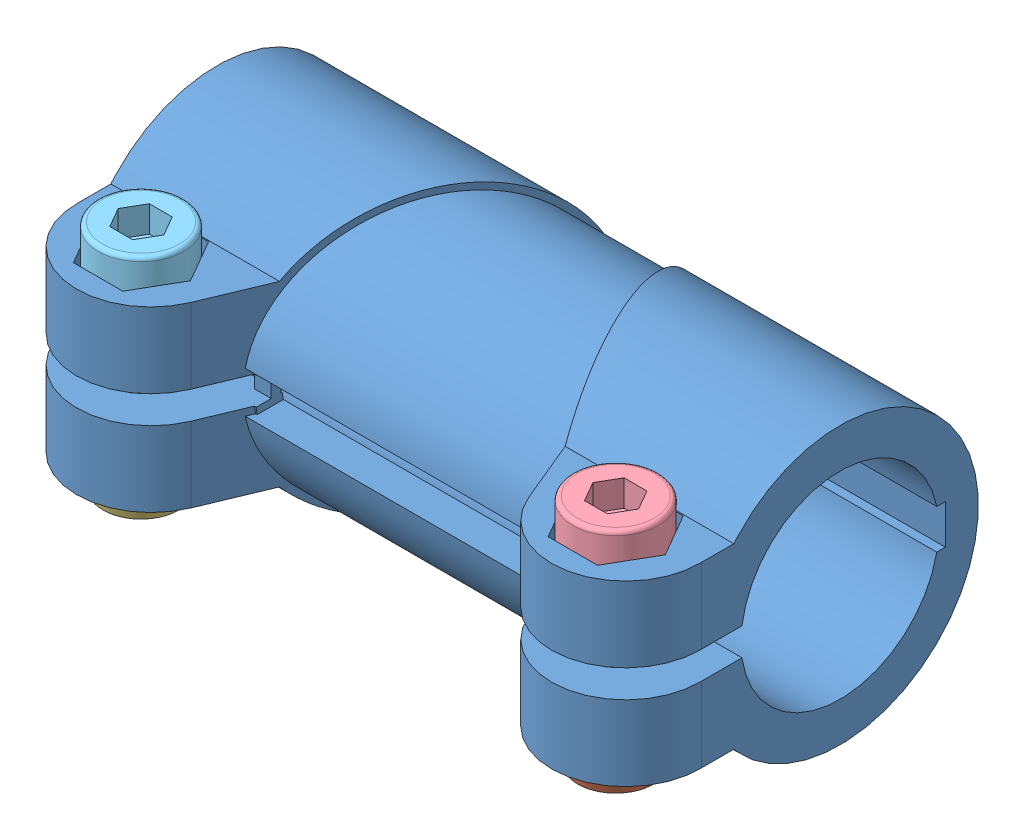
SolidWorks assembly TCC30-SL-B.sldasm, configuration Default (file format 15000). Lengths in mm.
Overall size (94.51 42.25 53.5).
5 component instances, 5 part files, 0 mates.
Components (placement in the parent):
- TCC30-SL-B_01-1: TCC30-SL-B_01.sldprt [ﾃﾞﾌｫﾙﾄ] at origin size (94.51 42.25 53.5)
- TCC30-SL-B_02-1: TCC30-SL-B_02.sldprt [ﾃﾞﾌｫﾙﾄ] at (36 -9.5 22.75) x (-1 0 0) z (0 0 1) size (17.77 8.01 17.77)
- TCC30-SL-B_03-1: TCC30-SL-B_03.sldprt [ﾃﾞﾌｫﾙﾄ] at (-36 -9.5 22.75) x (-1 0 0) z (0 0 1) size (17.77 8.01 17.77)
- TCC30-SL-B_04-1: TCC30-SL-B_04.sldprt [ﾃﾞﾌｫﾙﾄ] at (36 9.5 22.75) size (13 33 13)
- TCC30-SL-B_05-1: TCC30-SL-B_05.sldprt [ﾃﾞﾌｫﾙﾄ] at (-36 9.5 22.75) size (13 33 13)
